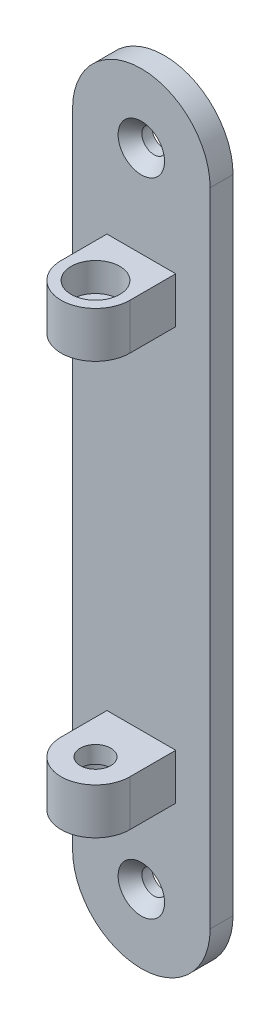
from build123d import *

# Parameters (mm, degrees)
EXTRUDE13_DEPTH = 6.35
SKETCH43_W      = 19.05
SKETCH43_H      = 12.7
EXTRUDE14_DEPTH = 12.7
EXTRUDE15_DEPTH = 12.7


with BuildPart() as part:
    # Sketch40 → Extrude13 (new body)
    with BuildSketch(Plane.XY):
        with BuildLine():
            Line((0, -88.9), (0, 88.9))
            ThreePointArc((0, 88.9), (19.05, 107.95), (38.1, 88.9))
            Line((38.1, 88.9), (38.1, -88.9))
            ThreePointArc((38.1, -88.9), (19.05, -107.95), (0, -88.9))
        make_face()
    extrude(amount=EXTRUDE13_DEPTH)

    # Sketch41 → CSK for 1_4 Flat Head Machine Screw6 (revolve, cut)
    with BuildSketch(Plane(origin=(19.05, 88.9, 6.35), x_dir=(0, -1, 0), z_dir=(1, 0, 0))):
        Polygon((0, 0), (0, 6.35), (3.3782, 6.35), (3.3782, 3.520932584), (6.4389, 0), align=None)
    csk_for_1_4_flat_head_machine_screw6 = revolve(axis=Axis((19.05, 88.9, 12.7), (0, 0, -1)), mode=Mode.SUBTRACT)

    # Sketch43 → Extrude14 (add)
    with BuildSketch(Plane.XY.offset(6.35)):
        with Locations((19.05, 57.15)):
            Rectangle(SKETCH43_W, SKETCH43_H)
    extrude14 = extrude(amount=EXTRUDE14_DEPTH)

    # Sketch44 → Extrude15 (add)
    with BuildSketch(Plane(origin=(0, 63.5, 0), x_dir=(-1, 0, 0), z_dir=(0, 1, 0))):
        with BuildLine():
            Line((-9.525, 19.05), (-28.575, 19.05))
            ThreePointArc((-28.575, 19.05), (-19.05, 28.575), (-9.525, 19.05))
        make_face()
    extrude15 = extrude(amount=-EXTRUDE15_DEPTH)

    # Sketch45 → CBORE for 5_16 Socket Head Cap Screw4 (revolve, cut)
    with BuildSketch(Plane(origin=(19.05, 63.5, 19.05), x_dir=(0, 0, 1), z_dir=(1, 0, 0))):
        Polygon((0, 0), (0, 15.233468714), (4.2164, 12.7), (4.2164, 7.9375), (6.74751, 7.9375), (6.74751, 0), align=None)
    cbore_for_5_16_socket_head_cap_screw4 = revolve(axis=Axis((19.05, 69.85, 19.05), (0, -1, 0)), mode=Mode.SUBTRACT)

    # Mirror4: CSK for 1_4 Flat Head Machine Screw6, Extrude14, Extrude15, CBORE for 5_16 Socket Head Cap Screw4 across plane
    add(csk_for_1_4_flat_head_machine_screw6.mirror(Plane.ZX), mode=Mode.SUBTRACT)
    add(extrude14.mirror(Plane.ZX))
    add(extrude15.mirror(Plane.ZX))
    add(cbore_for_5_16_socket_head_cap_screw4.mirror(Plane.ZX), mode=Mode.SUBTRACT)


solid = part.part
